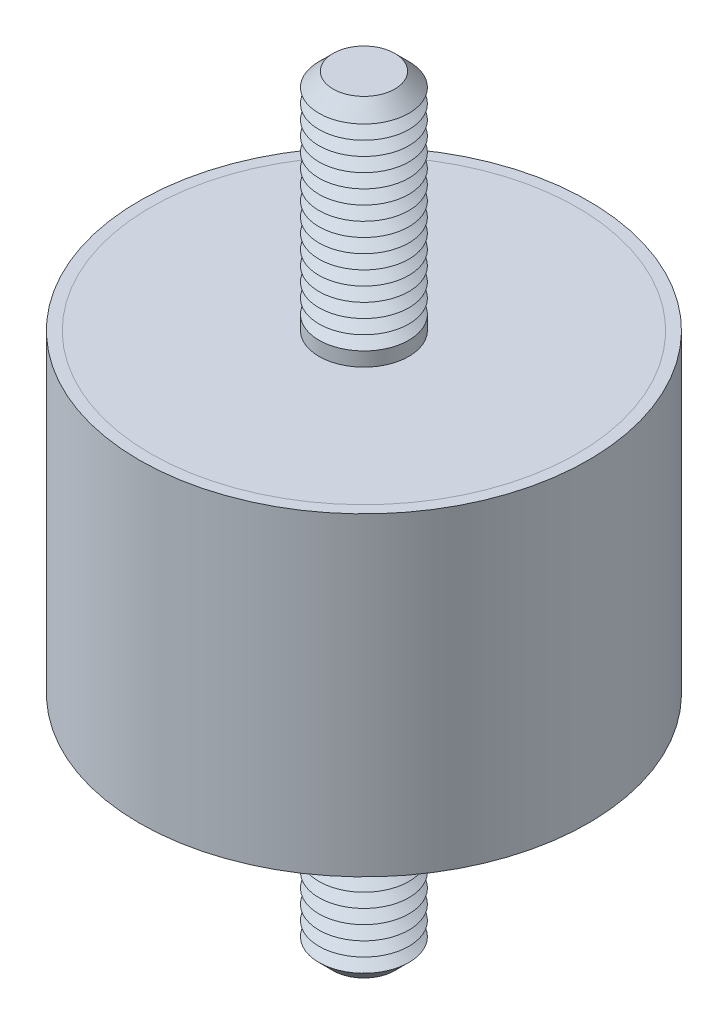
ISO-10303-21;
HEADER;
FILE_DESCRIPTION(('STEP AP214'),'2;1');
FILE_NAME('part.step','',(''),(''),'','','');
FILE_SCHEMA(('AUTOMOTIVE_DESIGN { 1 0 10303 214 1 1 1 1 }'));
ENDSEC;
DATA;
#1=APPLICATION_CONTEXT('core data for automotive mechanical design processes');
#2=APPLICATION_PROTOCOL_DEFINITION('international standard','automotive_design',2000,#1);
#3=PRODUCT_CONTEXT('',#1,'mechanical');
#4=PRODUCT('Part','Part','',(#3));
#5=PRODUCT_RELATED_PRODUCT_CATEGORY('part','',(#4));
#6=PRODUCT_DEFINITION_FORMATION('','',#4);
#7=PRODUCT_DEFINITION_CONTEXT('part definition',#1,'design');
#8=PRODUCT_DEFINITION('design','',#6,#7);
#9=PRODUCT_DEFINITION_SHAPE('','',#8);
#10=(LENGTH_UNIT() NAMED_UNIT(*) SI_UNIT(.MILLI.,.METRE.));
#11=(NAMED_UNIT(*) PLANE_ANGLE_UNIT() SI_UNIT($,.RADIAN.));
#12=(NAMED_UNIT(*) SI_UNIT($,.STERADIAN.) SOLID_ANGLE_UNIT());
#13=UNCERTAINTY_MEASURE_WITH_UNIT(LENGTH_MEASURE(1.E-05),#10,'distance_accuracy_value','');
#14=(GEOMETRIC_REPRESENTATION_CONTEXT(3) GLOBAL_UNCERTAINTY_ASSIGNED_CONTEXT((#13)) GLOBAL_UNIT_ASSIGNED_CONTEXT((#10,
#11,#12)) REPRESENTATION_CONTEXT('',''));
#15=CARTESIAN_POINT('',(0.,0.,0.));
#16=DIRECTION('',(0.,0.,1.));
#17=DIRECTION('',(1.,0.,0.));
#18=AXIS2_PLACEMENT_3D('',#15,#16,#17);
#19=CARTESIAN_POINT('',(0.,-34.,0.));
#20=DIRECTION('',(0.,1.,0.));
#21=DIRECTION('',(0.,0.,1.));
#22=AXIS2_PLACEMENT_3D('',#19,#20,#21);
#23=CYLINDRICAL_SURFACE('',#22,4.);
#24=CARTESIAN_POINT('',(0.,-14.,0.));
#25=DIRECTION('',(0.,-1.,0.));
#26=DIRECTION('',(0.,0.,-1.));
#27=AXIS2_PLACEMENT_3D('',#24,#25,#26);
#28=CIRCLE('',#27,4.);
#29=CARTESIAN_POINT('',(0.,-14.,-4.));
#30=VERTEX_POINT('',#29);
#31=EDGE_CURVE('P0_E21',#30,#30,#28,.T.);
#32=ORIENTED_EDGE('',*,*,#31,.T.);
#33=EDGE_LOOP('',(#32));
#34=FACE_BOUND('',#33,.T.);
#35=CARTESIAN_POINT('',(0.,-15.25,0.));
#36=DIRECTION('',(0.,1.,0.));
#37=DIRECTION('',(0.,0.,1.));
#38=AXIS2_PLACEMENT_3D('',#35,#36,#37);
#39=CIRCLE('',#38,4.);
#40=CARTESIAN_POINT('',(0.,-15.25,4.));
#41=VERTEX_POINT('',#40);
#42=EDGE_CURVE('P0_E33',#41,#41,#39,.T.);
#43=ORIENTED_EDGE('',*,*,#42,.T.);
#44=EDGE_LOOP('',(#43));
#45=FACE_BOUND('',#44,.T.);
#46=ADVANCED_FACE('P0_F14',(#34,#45),#23,.T.);
#47=CARTESIAN_POINT('',(0.,-14.,0.));
#48=DIRECTION('',(0.,1.,0.));
#49=DIRECTION('',(0.,0.,1.));
#50=AXIS2_PLACEMENT_3D('',#47,#48,#49);
#51=CYLINDRICAL_SURFACE('',#50,19.);
#52=CARTESIAN_POINT('',(0.,-14.,0.));
#53=DIRECTION('',(0.,1.,0.));
#54=DIRECTION('',(0.,0.,1.));
#55=AXIS2_PLACEMENT_3D('',#52,#53,#54);
#56=CIRCLE('',#55,19.);
#57=CARTESIAN_POINT('',(0.,-14.,19.));
#58=VERTEX_POINT('',#57);
#59=EDGE_CURVE('P0_E25',#58,#58,#56,.T.);
#60=ORIENTED_EDGE('',*,*,#59,.T.);
#61=EDGE_LOOP('',(#60));
#62=FACE_BOUND('',#61,.T.);
#63=CARTESIAN_POINT('',(0.,-13.,0.));
#64=DIRECTION('',(0.,1.,0.));
#65=DIRECTION('',(0.,0.,1.));
#66=AXIS2_PLACEMENT_3D('',#63,#64,#65);
#67=CIRCLE('',#66,19.);
#68=CARTESIAN_POINT('',(0.,-13.,19.));
#69=VERTEX_POINT('',#68);
#70=EDGE_CURVE('P0_E30',#69,#69,#67,.T.);
#71=ORIENTED_EDGE('',*,*,#70,.F.);
#72=EDGE_LOOP('',(#71));
#73=FACE_BOUND('',#72,.T.);
#74=ADVANCED_FACE('P0_F145',(#62,#73),#51,.T.);
#75=CARTESIAN_POINT('',(0.,-14.,0.));
#76=DIRECTION('',(0.,1.,0.));
#77=DIRECTION('',(0.,0.,1.));
#78=AXIS2_PLACEMENT_3D('',#75,#76,#77);
#79=PLANE('',#78);
#80=ORIENTED_EDGE('',*,*,#31,.F.);
#81=EDGE_LOOP('',(#80));
#82=FACE_BOUND('',#81,.T.);
#83=ORIENTED_EDGE('',*,*,#59,.F.);
#84=EDGE_LOOP('',(#83));
#85=FACE_BOUND('',#84,.T.);
#86=ADVANCED_FACE('P0_F150',(#82,#85),#79,.F.);
#87=CARTESIAN_POINT('',(0.,-13.,0.));
#88=DIRECTION('',(0.,1.,0.));
#89=DIRECTION('',(0.,0.,1.));
#90=AXIS2_PLACEMENT_3D('',#87,#88,#89);
#91=PLANE('',#90);
#92=ORIENTED_EDGE('',*,*,#70,.T.);
#93=EDGE_LOOP('',(#92));
#94=FACE_BOUND('',#93,.T.);
#95=ADVANCED_FACE('P0_F156',(#94),#91,.T.);
#96=CARTESIAN_POINT('',(0.,-15.25,0.));
#97=DIRECTION('',(0.,1.,0.));
#98=DIRECTION('',(0.,0.,1.));
#99=AXIS2_PLACEMENT_3D('',#96,#97,#98);
#100=CONICAL_SURFACE('',#99,4.,1.0471975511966);
#101=CARTESIAN_POINT('',(0.,-15.875,0.));
#102=DIRECTION('',(0.,1.,0.));
#103=DIRECTION('',(0.,0.,1.));
#104=AXIS2_PLACEMENT_3D('',#101,#102,#103);
#105=CIRCLE('',#104,2.91746824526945);
#106=CARTESIAN_POINT('',(0.,-15.875,2.91746824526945));
#107=VERTEX_POINT('',#106);
#108=EDGE_CURVE('P0_E39',#107,#107,#105,.T.);
#109=ORIENTED_EDGE('',*,*,#108,.T.);
#110=EDGE_LOOP('',(#109));
#111=FACE_BOUND('',#110,.T.);
#112=ORIENTED_EDGE('',*,*,#42,.F.);
#113=EDGE_LOOP('',(#112));
#114=FACE_BOUND('',#113,.T.);
#115=ADVANCED_FACE('P0_F159',(#111,#114),#100,.T.);
#116=CARTESIAN_POINT('',(0.,-15.875,0.));
#117=DIRECTION('',(0.,-1.,0.));
#118=DIRECTION('',(0.,0.,-1.));
#119=AXIS2_PLACEMENT_3D('',#116,#117,#118);
#120=CONICAL_SURFACE('',#119,2.91746824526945,1.0471975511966);
#121=CARTESIAN_POINT('',(0.,-16.5,0.));
#122=DIRECTION('',(0.,1.,0.));
#123=DIRECTION('',(0.,0.,1.));
#124=AXIS2_PLACEMENT_3D('',#121,#122,#123);
#125=CIRCLE('',#124,4.);
#126=CARTESIAN_POINT('',(0.,-16.5,4.));
#127=VERTEX_POINT('',#126);
#128=EDGE_CURVE('P0_E43',#127,#127,#125,.T.);
#129=ORIENTED_EDGE('',*,*,#128,.T.);
#130=EDGE_LOOP('',(#129));
#131=FACE_BOUND('',#130,.T.);
#132=ORIENTED_EDGE('',*,*,#108,.F.);
#133=EDGE_LOOP('',(#132));
#134=FACE_BOUND('',#133,.T.);
#135=ADVANCED_FACE('P0_F163',(#131,#134),#120,.T.);
#136=CARTESIAN_POINT('',(0.,-16.5,0.));
#137=DIRECTION('',(0.,1.,0.));
#138=DIRECTION('',(0.,0.,1.));
#139=AXIS2_PLACEMENT_3D('',#136,#137,#138);
#140=CONICAL_SURFACE('',#139,4.,1.0471975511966);
#141=CARTESIAN_POINT('',(0.,-17.125,0.));
#142=DIRECTION('',(0.,1.,0.));
#143=DIRECTION('',(0.,0.,1.));
#144=AXIS2_PLACEMENT_3D('',#141,#142,#143);
#145=CIRCLE('',#144,2.91746824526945);
#146=CARTESIAN_POINT('',(0.,-17.125,2.91746824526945));
#147=VERTEX_POINT('',#146);
#148=EDGE_CURVE('P0_E47',#147,#147,#145,.T.);
#149=ORIENTED_EDGE('',*,*,#148,.T.);
#150=EDGE_LOOP('',(#149));
#151=FACE_BOUND('',#150,.T.);
#152=ORIENTED_EDGE('',*,*,#128,.F.);
#153=EDGE_LOOP('',(#152));
#154=FACE_BOUND('',#153,.T.);
#155=ADVANCED_FACE('P0_F167',(#151,#154),#140,.T.);
#156=CARTESIAN_POINT('',(0.,-17.125,0.));
#157=DIRECTION('',(0.,-1.,0.));
#158=DIRECTION('',(0.,0.,-1.));
#159=AXIS2_PLACEMENT_3D('',#156,#157,#158);
#160=CONICAL_SURFACE('',#159,2.91746824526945,1.0471975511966);
#161=CARTESIAN_POINT('',(0.,-17.75,0.));
#162=DIRECTION('',(0.,1.,0.));
#163=DIRECTION('',(0.,0.,1.));
#164=AXIS2_PLACEMENT_3D('',#161,#162,#163);
#165=CIRCLE('',#164,4.);
#166=CARTESIAN_POINT('',(0.,-17.75,4.));
#167=VERTEX_POINT('',#166);
#168=EDGE_CURVE('P0_E52',#167,#167,#165,.T.);
#169=ORIENTED_EDGE('',*,*,#168,.T.);
#170=EDGE_LOOP('',(#169));
#171=FACE_BOUND('',#170,.T.);
#172=ORIENTED_EDGE('',*,*,#148,.F.);
#173=EDGE_LOOP('',(#172));
#174=FACE_BOUND('',#173,.T.);
#175=ADVANCED_FACE('P0_F174',(#171,#174),#160,.T.);
#176=CARTESIAN_POINT('',(0.,-17.75,0.));
#177=DIRECTION('',(0.,1.,0.));
#178=DIRECTION('',(0.,0.,1.));
#179=AXIS2_PLACEMENT_3D('',#176,#177,#178);
#180=CONICAL_SURFACE('',#179,4.,1.0471975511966);
#181=CARTESIAN_POINT('',(0.,-18.375,0.));
#182=DIRECTION('',(0.,1.,0.));
#183=DIRECTION('',(0.,0.,1.));
#184=AXIS2_PLACEMENT_3D('',#181,#182,#183);
#185=CIRCLE('',#184,2.91746824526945);
#186=CARTESIAN_POINT('',(0.,-18.375,2.91746824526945));
#187=VERTEX_POINT('',#186);
#188=EDGE_CURVE('P0_E55',#187,#187,#185,.T.);
#189=ORIENTED_EDGE('',*,*,#188,.T.);
#190=EDGE_LOOP('',(#189));
#191=FACE_BOUND('',#190,.T.);
#192=ORIENTED_EDGE('',*,*,#168,.F.);
#193=EDGE_LOOP('',(#192));
#194=FACE_BOUND('',#193,.T.);
#195=ADVANCED_FACE('P0_F178',(#191,#194),#180,.T.);
#196=CARTESIAN_POINT('',(0.,-18.375,0.));
#197=DIRECTION('',(0.,-1.,0.));
#198=DIRECTION('',(0.,0.,-1.));
#199=AXIS2_PLACEMENT_3D('',#196,#197,#198);
#200=CONICAL_SURFACE('',#199,2.91746824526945,1.0471975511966);
#201=CARTESIAN_POINT('',(0.,-19.,0.));
#202=DIRECTION('',(0.,1.,0.));
#203=DIRECTION('',(0.,0.,1.));
#204=AXIS2_PLACEMENT_3D('',#201,#202,#203);
#205=CIRCLE('',#204,4.);
#206=CARTESIAN_POINT('',(0.,-19.,4.));
#207=VERTEX_POINT('',#206);
#208=EDGE_CURVE('P0_E58',#207,#207,#205,.T.);
#209=ORIENTED_EDGE('',*,*,#208,.T.);
#210=EDGE_LOOP('',(#209));
#211=FACE_BOUND('',#210,.T.);
#212=ORIENTED_EDGE('',*,*,#188,.F.);
#213=EDGE_LOOP('',(#212));
#214=FACE_BOUND('',#213,.T.);
#215=ADVANCED_FACE('P0_F182',(#211,#214),#200,.T.);
#216=CARTESIAN_POINT('',(0.,-19.,0.));
#217=DIRECTION('',(0.,1.,0.));
#218=DIRECTION('',(0.,0.,1.));
#219=AXIS2_PLACEMENT_3D('',#216,#217,#218);
#220=CONICAL_SURFACE('',#219,4.,1.0471975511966);
#221=CARTESIAN_POINT('',(0.,-19.625,0.));
#222=DIRECTION('',(0.,1.,0.));
#223=DIRECTION('',(0.,0.,1.));
#224=AXIS2_PLACEMENT_3D('',#221,#222,#223);
#225=CIRCLE('',#224,2.91746824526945);
#226=CARTESIAN_POINT('',(0.,-19.625,2.91746824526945));
#227=VERTEX_POINT('',#226);
#228=EDGE_CURVE('P0_E61',#227,#227,#225,.T.);
#229=ORIENTED_EDGE('',*,*,#228,.T.);
#230=EDGE_LOOP('',(#229));
#231=FACE_BOUND('',#230,.T.);
#232=ORIENTED_EDGE('',*,*,#208,.F.);
#233=EDGE_LOOP('',(#232));
#234=FACE_BOUND('',#233,.T.);
#235=ADVANCED_FACE('P0_F186',(#231,#234),#220,.T.);
#236=CARTESIAN_POINT('',(0.,-19.625,0.));
#237=DIRECTION('',(0.,-1.,0.));
#238=DIRECTION('',(0.,0.,-1.));
#239=AXIS2_PLACEMENT_3D('',#236,#237,#238);
#240=CONICAL_SURFACE('',#239,2.91746824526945,1.0471975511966);
#241=CARTESIAN_POINT('',(0.,-20.25,0.));
#242=DIRECTION('',(0.,1.,0.));
#243=DIRECTION('',(0.,0.,1.));
#244=AXIS2_PLACEMENT_3D('',#241,#242,#243);
#245=CIRCLE('',#244,4.);
#246=CARTESIAN_POINT('',(0.,-20.25,4.));
#247=VERTEX_POINT('',#246);
#248=EDGE_CURVE('P0_E64',#247,#247,#245,.T.);
#249=ORIENTED_EDGE('',*,*,#248,.T.);
#250=EDGE_LOOP('',(#249));
#251=FACE_BOUND('',#250,.T.);
#252=ORIENTED_EDGE('',*,*,#228,.F.);
#253=EDGE_LOOP('',(#252));
#254=FACE_BOUND('',#253,.T.);
#255=ADVANCED_FACE('P0_F190',(#251,#254),#240,.T.);
#256=CARTESIAN_POINT('',(0.,-20.25,0.));
#257=DIRECTION('',(0.,1.,0.));
#258=DIRECTION('',(0.,0.,1.));
#259=AXIS2_PLACEMENT_3D('',#256,#257,#258);
#260=CONICAL_SURFACE('',#259,4.,1.0471975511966);
#261=CARTESIAN_POINT('',(0.,-20.875,0.));
#262=DIRECTION('',(0.,1.,0.));
#263=DIRECTION('',(0.,0.,1.));
#264=AXIS2_PLACEMENT_3D('',#261,#262,#263);
#265=CIRCLE('',#264,2.91746824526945);
#266=CARTESIAN_POINT('',(0.,-20.875,2.91746824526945));
#267=VERTEX_POINT('',#266);
#268=EDGE_CURVE('P0_E67',#267,#267,#265,.T.);
#269=ORIENTED_EDGE('',*,*,#268,.T.);
#270=EDGE_LOOP('',(#269));
#271=FACE_BOUND('',#270,.T.);
#272=ORIENTED_EDGE('',*,*,#248,.F.);
#273=EDGE_LOOP('',(#272));
#274=FACE_BOUND('',#273,.T.);
#275=ADVANCED_FACE('P0_F194',(#271,#274),#260,.T.);
#276=CARTESIAN_POINT('',(0.,-20.875,0.));
#277=DIRECTION('',(0.,-1.,0.));
#278=DIRECTION('',(0.,0.,-1.));
#279=AXIS2_PLACEMENT_3D('',#276,#277,#278);
#280=CONICAL_SURFACE('',#279,2.91746824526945,1.0471975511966);
#281=CARTESIAN_POINT('',(0.,-21.5,0.));
#282=DIRECTION('',(0.,1.,0.));
#283=DIRECTION('',(0.,0.,1.));
#284=AXIS2_PLACEMENT_3D('',#281,#282,#283);
#285=CIRCLE('',#284,4.);
#286=CARTESIAN_POINT('',(0.,-21.5,4.));
#287=VERTEX_POINT('',#286);
#288=EDGE_CURVE('P0_E70',#287,#287,#285,.T.);
#289=ORIENTED_EDGE('',*,*,#288,.T.);
#290=EDGE_LOOP('',(#289));
#291=FACE_BOUND('',#290,.T.);
#292=ORIENTED_EDGE('',*,*,#268,.F.);
#293=EDGE_LOOP('',(#292));
#294=FACE_BOUND('',#293,.T.);
#295=ADVANCED_FACE('P0_F198',(#291,#294),#280,.T.);
#296=CARTESIAN_POINT('',(0.,-21.5,0.));
#297=DIRECTION('',(0.,1.,0.));
#298=DIRECTION('',(0.,0.,1.));
#299=AXIS2_PLACEMENT_3D('',#296,#297,#298);
#300=CONICAL_SURFACE('',#299,4.,1.0471975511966);
#301=CARTESIAN_POINT('',(0.,-22.125,0.));
#302=DIRECTION('',(0.,1.,0.));
#303=DIRECTION('',(0.,0.,1.));
#304=AXIS2_PLACEMENT_3D('',#301,#302,#303);
#305=CIRCLE('',#304,2.91746824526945);
#306=CARTESIAN_POINT('',(0.,-22.125,2.91746824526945));
#307=VERTEX_POINT('',#306);
#308=EDGE_CURVE('P0_E73',#307,#307,#305,.T.);
#309=ORIENTED_EDGE('',*,*,#308,.T.);
#310=EDGE_LOOP('',(#309));
#311=FACE_BOUND('',#310,.T.);
#312=ORIENTED_EDGE('',*,*,#288,.F.);
#313=EDGE_LOOP('',(#312));
#314=FACE_BOUND('',#313,.T.);
#315=ADVANCED_FACE('P0_F202',(#311,#314),#300,.T.);
#316=CARTESIAN_POINT('',(0.,-22.125,0.));
#317=DIRECTION('',(0.,-1.,0.));
#318=DIRECTION('',(0.,0.,-1.));
#319=AXIS2_PLACEMENT_3D('',#316,#317,#318);
#320=CONICAL_SURFACE('',#319,2.91746824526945,1.0471975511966);
#321=CARTESIAN_POINT('',(0.,-22.75,0.));
#322=DIRECTION('',(0.,1.,0.));
#323=DIRECTION('',(0.,0.,1.));
#324=AXIS2_PLACEMENT_3D('',#321,#322,#323);
#325=CIRCLE('',#324,4.);
#326=CARTESIAN_POINT('',(0.,-22.75,4.));
#327=VERTEX_POINT('',#326);
#328=EDGE_CURVE('P0_E76',#327,#327,#325,.T.);
#329=ORIENTED_EDGE('',*,*,#328,.T.);
#330=EDGE_LOOP('',(#329));
#331=FACE_BOUND('',#330,.T.);
#332=ORIENTED_EDGE('',*,*,#308,.F.);
#333=EDGE_LOOP('',(#332));
#334=FACE_BOUND('',#333,.T.);
#335=ADVANCED_FACE('P0_F206',(#331,#334),#320,.T.);
#336=CARTESIAN_POINT('',(0.,-22.75,0.));
#337=DIRECTION('',(0.,1.,0.));
#338=DIRECTION('',(0.,0.,1.));
#339=AXIS2_PLACEMENT_3D('',#336,#337,#338);
#340=CONICAL_SURFACE('',#339,4.,1.0471975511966);
#341=CARTESIAN_POINT('',(0.,-23.375,0.));
#342=DIRECTION('',(0.,1.,0.));
#343=DIRECTION('',(0.,0.,1.));
#344=AXIS2_PLACEMENT_3D('',#341,#342,#343);
#345=CIRCLE('',#344,2.91746824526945);
#346=CARTESIAN_POINT('',(0.,-23.375,2.91746824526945));
#347=VERTEX_POINT('',#346);
#348=EDGE_CURVE('P0_E79',#347,#347,#345,.T.);
#349=ORIENTED_EDGE('',*,*,#348,.T.);
#350=EDGE_LOOP('',(#349));
#351=FACE_BOUND('',#350,.T.);
#352=ORIENTED_EDGE('',*,*,#328,.F.);
#353=EDGE_LOOP('',(#352));
#354=FACE_BOUND('',#353,.T.);
#355=ADVANCED_FACE('P0_F210',(#351,#354),#340,.T.);
#356=CARTESIAN_POINT('',(0.,-23.375,0.));
#357=DIRECTION('',(0.,-1.,0.));
#358=DIRECTION('',(0.,0.,-1.));
#359=AXIS2_PLACEMENT_3D('',#356,#357,#358);
#360=CONICAL_SURFACE('',#359,2.91746824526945,1.0471975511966);
#361=CARTESIAN_POINT('',(0.,-24.,0.));
#362=DIRECTION('',(0.,1.,0.));
#363=DIRECTION('',(0.,0.,1.));
#364=AXIS2_PLACEMENT_3D('',#361,#362,#363);
#365=CIRCLE('',#364,4.);
#366=CARTESIAN_POINT('',(0.,-24.,4.));
#367=VERTEX_POINT('',#366);
#368=EDGE_CURVE('P0_E82',#367,#367,#365,.T.);
#369=ORIENTED_EDGE('',*,*,#368,.T.);
#370=EDGE_LOOP('',(#369));
#371=FACE_BOUND('',#370,.T.);
#372=ORIENTED_EDGE('',*,*,#348,.F.);
#373=EDGE_LOOP('',(#372));
#374=FACE_BOUND('',#373,.T.);
#375=ADVANCED_FACE('P0_F214',(#371,#374),#360,.T.);
#376=CARTESIAN_POINT('',(0.,-24.,0.));
#377=DIRECTION('',(0.,1.,0.));
#378=DIRECTION('',(0.,0.,1.));
#379=AXIS2_PLACEMENT_3D('',#376,#377,#378);
#380=CONICAL_SURFACE('',#379,4.,1.0471975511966);
#381=CARTESIAN_POINT('',(0.,-24.625,0.));
#382=DIRECTION('',(0.,1.,0.));
#383=DIRECTION('',(0.,0.,1.));
#384=AXIS2_PLACEMENT_3D('',#381,#382,#383);
#385=CIRCLE('',#384,2.91746824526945);
#386=CARTESIAN_POINT('',(0.,-24.625,2.91746824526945));
#387=VERTEX_POINT('',#386);
#388=EDGE_CURVE('P0_E85',#387,#387,#385,.T.);
#389=ORIENTED_EDGE('',*,*,#388,.T.);
#390=EDGE_LOOP('',(#389));
#391=FACE_BOUND('',#390,.T.);
#392=ORIENTED_EDGE('',*,*,#368,.F.);
#393=EDGE_LOOP('',(#392));
#394=FACE_BOUND('',#393,.T.);
#395=ADVANCED_FACE('P0_F218',(#391,#394),#380,.T.);
#396=CARTESIAN_POINT('',(0.,-24.625,0.));
#397=DIRECTION('',(0.,-1.,0.));
#398=DIRECTION('',(0.,0.,-1.));
#399=AXIS2_PLACEMENT_3D('',#396,#397,#398);
#400=CONICAL_SURFACE('',#399,2.91746824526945,1.0471975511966);
#401=CARTESIAN_POINT('',(0.,-25.25,0.));
#402=DIRECTION('',(0.,1.,0.));
#403=DIRECTION('',(0.,0.,1.));
#404=AXIS2_PLACEMENT_3D('',#401,#402,#403);
#405=CIRCLE('',#404,4.);
#406=CARTESIAN_POINT('',(0.,-25.25,4.));
#407=VERTEX_POINT('',#406);
#408=EDGE_CURVE('P0_E88',#407,#407,#405,.T.);
#409=ORIENTED_EDGE('',*,*,#408,.T.);
#410=EDGE_LOOP('',(#409));
#411=FACE_BOUND('',#410,.T.);
#412=ORIENTED_EDGE('',*,*,#388,.F.);
#413=EDGE_LOOP('',(#412));
#414=FACE_BOUND('',#413,.T.);
#415=ADVANCED_FACE('P0_F222',(#411,#414),#400,.T.);
#416=CARTESIAN_POINT('',(0.,-25.25,0.));
#417=DIRECTION('',(0.,1.,0.));
#418=DIRECTION('',(0.,0.,1.));
#419=AXIS2_PLACEMENT_3D('',#416,#417,#418);
#420=CONICAL_SURFACE('',#419,4.,1.0471975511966);
#421=CARTESIAN_POINT('',(0.,-25.875,0.));
#422=DIRECTION('',(0.,1.,0.));
#423=DIRECTION('',(0.,0.,1.));
#424=AXIS2_PLACEMENT_3D('',#421,#422,#423);
#425=CIRCLE('',#424,2.91746824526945);
#426=CARTESIAN_POINT('',(0.,-25.875,2.91746824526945));
#427=VERTEX_POINT('',#426);
#428=EDGE_CURVE('P0_E91',#427,#427,#425,.T.);
#429=ORIENTED_EDGE('',*,*,#428,.T.);
#430=EDGE_LOOP('',(#429));
#431=FACE_BOUND('',#430,.T.);
#432=ORIENTED_EDGE('',*,*,#408,.F.);
#433=EDGE_LOOP('',(#432));
#434=FACE_BOUND('',#433,.T.);
#435=ADVANCED_FACE('P0_F226',(#431,#434),#420,.T.);
#436=CARTESIAN_POINT('',(0.,-25.875,0.));
#437=DIRECTION('',(0.,-1.,0.));
#438=DIRECTION('',(0.,0.,-1.));
#439=AXIS2_PLACEMENT_3D('',#436,#437,#438);
#440=CONICAL_SURFACE('',#439,2.91746824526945,1.0471975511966);
#441=CARTESIAN_POINT('',(0.,-26.5,0.));
#442=DIRECTION('',(0.,1.,0.));
#443=DIRECTION('',(0.,0.,1.));
#444=AXIS2_PLACEMENT_3D('',#441,#442,#443);
#445=CIRCLE('',#444,4.);
#446=CARTESIAN_POINT('',(0.,-26.5,4.));
#447=VERTEX_POINT('',#446);
#448=EDGE_CURVE('P0_E94',#447,#447,#445,.T.);
#449=ORIENTED_EDGE('',*,*,#448,.T.);
#450=EDGE_LOOP('',(#449));
#451=FACE_BOUND('',#450,.T.);
#452=ORIENTED_EDGE('',*,*,#428,.F.);
#453=EDGE_LOOP('',(#452));
#454=FACE_BOUND('',#453,.T.);
#455=ADVANCED_FACE('P0_F230',(#451,#454),#440,.T.);
#456=CARTESIAN_POINT('',(0.,-26.5,0.));
#457=DIRECTION('',(0.,1.,0.));
#458=DIRECTION('',(0.,0.,1.));
#459=AXIS2_PLACEMENT_3D('',#456,#457,#458);
#460=CONICAL_SURFACE('',#459,4.,1.0471975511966);
#461=CARTESIAN_POINT('',(0.,-27.125,0.));
#462=DIRECTION('',(0.,1.,0.));
#463=DIRECTION('',(0.,0.,1.));
#464=AXIS2_PLACEMENT_3D('',#461,#462,#463);
#465=CIRCLE('',#464,2.91746824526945);
#466=CARTESIAN_POINT('',(0.,-27.125,2.91746824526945));
#467=VERTEX_POINT('',#466);
#468=EDGE_CURVE('P0_E97',#467,#467,#465,.T.);
#469=ORIENTED_EDGE('',*,*,#468,.T.);
#470=EDGE_LOOP('',(#469));
#471=FACE_BOUND('',#470,.T.);
#472=ORIENTED_EDGE('',*,*,#448,.F.);
#473=EDGE_LOOP('',(#472));
#474=FACE_BOUND('',#473,.T.);
#475=ADVANCED_FACE('P0_F234',(#471,#474),#460,.T.);
#476=CARTESIAN_POINT('',(0.,-27.125,0.));
#477=DIRECTION('',(0.,-1.,0.));
#478=DIRECTION('',(0.,0.,-1.));
#479=AXIS2_PLACEMENT_3D('',#476,#477,#478);
#480=CONICAL_SURFACE('',#479,2.91746824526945,1.0471975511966);
#481=CARTESIAN_POINT('',(0.,-27.75,0.));
#482=DIRECTION('',(0.,1.,0.));
#483=DIRECTION('',(0.,0.,1.));
#484=AXIS2_PLACEMENT_3D('',#481,#482,#483);
#485=CIRCLE('',#484,4.);
#486=CARTESIAN_POINT('',(0.,-27.75,4.));
#487=VERTEX_POINT('',#486);
#488=EDGE_CURVE('P0_E100',#487,#487,#485,.T.);
#489=ORIENTED_EDGE('',*,*,#488,.T.);
#490=EDGE_LOOP('',(#489));
#491=FACE_BOUND('',#490,.T.);
#492=ORIENTED_EDGE('',*,*,#468,.F.);
#493=EDGE_LOOP('',(#492));
#494=FACE_BOUND('',#493,.T.);
#495=ADVANCED_FACE('P0_F238',(#491,#494),#480,.T.);
#496=CARTESIAN_POINT('',(0.,-27.75,0.));
#497=DIRECTION('',(0.,1.,0.));
#498=DIRECTION('',(0.,0.,1.));
#499=AXIS2_PLACEMENT_3D('',#496,#497,#498);
#500=CONICAL_SURFACE('',#499,4.,1.0471975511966);
#501=CARTESIAN_POINT('',(0.,-28.375,0.));
#502=DIRECTION('',(0.,1.,0.));
#503=DIRECTION('',(0.,0.,1.));
#504=AXIS2_PLACEMENT_3D('',#501,#502,#503);
#505=CIRCLE('',#504,2.91746824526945);
#506=CARTESIAN_POINT('',(0.,-28.375,2.91746824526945));
#507=VERTEX_POINT('',#506);
#508=EDGE_CURVE('P0_E103',#507,#507,#505,.T.);
#509=ORIENTED_EDGE('',*,*,#508,.T.);
#510=EDGE_LOOP('',(#509));
#511=FACE_BOUND('',#510,.T.);
#512=ORIENTED_EDGE('',*,*,#488,.F.);
#513=EDGE_LOOP('',(#512));
#514=FACE_BOUND('',#513,.T.);
#515=ADVANCED_FACE('P0_F242',(#511,#514),#500,.T.);
#516=CARTESIAN_POINT('',(0.,-28.375,0.));
#517=DIRECTION('',(0.,-1.,0.));
#518=DIRECTION('',(0.,0.,-1.));
#519=AXIS2_PLACEMENT_3D('',#516,#517,#518);
#520=CONICAL_SURFACE('',#519,2.91746824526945,1.0471975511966);
#521=CARTESIAN_POINT('',(0.,-29.,0.));
#522=DIRECTION('',(0.,1.,0.));
#523=DIRECTION('',(0.,0.,1.));
#524=AXIS2_PLACEMENT_3D('',#521,#522,#523);
#525=CIRCLE('',#524,4.);
#526=CARTESIAN_POINT('',(0.,-29.,4.));
#527=VERTEX_POINT('',#526);
#528=EDGE_CURVE('P0_E106',#527,#527,#525,.T.);
#529=ORIENTED_EDGE('',*,*,#528,.T.);
#530=EDGE_LOOP('',(#529));
#531=FACE_BOUND('',#530,.T.);
#532=ORIENTED_EDGE('',*,*,#508,.F.);
#533=EDGE_LOOP('',(#532));
#534=FACE_BOUND('',#533,.T.);
#535=ADVANCED_FACE('P0_F246',(#531,#534),#520,.T.);
#536=CARTESIAN_POINT('',(0.,-29.,0.));
#537=DIRECTION('',(0.,1.,0.));
#538=DIRECTION('',(0.,0.,1.));
#539=AXIS2_PLACEMENT_3D('',#536,#537,#538);
#540=CONICAL_SURFACE('',#539,4.,1.0471975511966);
#541=CARTESIAN_POINT('',(0.,-29.625,0.));
#542=DIRECTION('',(0.,1.,0.));
#543=DIRECTION('',(0.,0.,1.));
#544=AXIS2_PLACEMENT_3D('',#541,#542,#543);
#545=CIRCLE('',#544,2.91746824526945);
#546=CARTESIAN_POINT('',(0.,-29.625,2.91746824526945));
#547=VERTEX_POINT('',#546);
#548=EDGE_CURVE('P0_E109',#547,#547,#545,.T.);
#549=ORIENTED_EDGE('',*,*,#548,.T.);
#550=EDGE_LOOP('',(#549));
#551=FACE_BOUND('',#550,.T.);
#552=ORIENTED_EDGE('',*,*,#528,.F.);
#553=EDGE_LOOP('',(#552));
#554=FACE_BOUND('',#553,.T.);
#555=ADVANCED_FACE('P0_F250',(#551,#554),#540,.T.);
#556=CARTESIAN_POINT('',(0.,-29.625,0.));
#557=DIRECTION('',(0.,-1.,0.));
#558=DIRECTION('',(0.,0.,-1.));
#559=AXIS2_PLACEMENT_3D('',#556,#557,#558);
#560=CONICAL_SURFACE('',#559,2.91746824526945,1.0471975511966);
#561=CARTESIAN_POINT('',(0.,-30.25,0.));
#562=DIRECTION('',(0.,1.,0.));
#563=DIRECTION('',(0.,0.,1.));
#564=AXIS2_PLACEMENT_3D('',#561,#562,#563);
#565=CIRCLE('',#564,4.);
#566=CARTESIAN_POINT('',(0.,-30.25,4.));
#567=VERTEX_POINT('',#566);
#568=EDGE_CURVE('P0_E112',#567,#567,#565,.T.);
#569=ORIENTED_EDGE('',*,*,#568,.T.);
#570=EDGE_LOOP('',(#569));
#571=FACE_BOUND('',#570,.T.);
#572=ORIENTED_EDGE('',*,*,#548,.F.);
#573=EDGE_LOOP('',(#572));
#574=FACE_BOUND('',#573,.T.);
#575=ADVANCED_FACE('P0_F254',(#571,#574),#560,.T.);
#576=CARTESIAN_POINT('',(0.,-30.25,0.));
#577=DIRECTION('',(0.,1.,0.));
#578=DIRECTION('',(0.,0.,1.));
#579=AXIS2_PLACEMENT_3D('',#576,#577,#578);
#580=CONICAL_SURFACE('',#579,4.,1.0471975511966);
#581=CARTESIAN_POINT('',(0.,-30.875,0.));
#582=DIRECTION('',(0.,1.,0.));
#583=DIRECTION('',(0.,0.,1.));
#584=AXIS2_PLACEMENT_3D('',#581,#582,#583);
#585=CIRCLE('',#584,2.91746824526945);
#586=CARTESIAN_POINT('',(0.,-30.875,2.91746824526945));
#587=VERTEX_POINT('',#586);
#588=EDGE_CURVE('P0_E115',#587,#587,#585,.T.);
#589=ORIENTED_EDGE('',*,*,#588,.T.);
#590=EDGE_LOOP('',(#589));
#591=FACE_BOUND('',#590,.T.);
#592=ORIENTED_EDGE('',*,*,#568,.F.);
#593=EDGE_LOOP('',(#592));
#594=FACE_BOUND('',#593,.T.);
#595=ADVANCED_FACE('P0_F258',(#591,#594),#580,.T.);
#596=CARTESIAN_POINT('',(0.,-30.875,0.));
#597=DIRECTION('',(0.,-1.,0.));
#598=DIRECTION('',(0.,0.,-1.));
#599=AXIS2_PLACEMENT_3D('',#596,#597,#598);
#600=CONICAL_SURFACE('',#599,2.91746824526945,1.0471975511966);
#601=CARTESIAN_POINT('',(0.,-31.5,0.));
#602=DIRECTION('',(0.,1.,0.));
#603=DIRECTION('',(0.,0.,1.));
#604=AXIS2_PLACEMENT_3D('',#601,#602,#603);
#605=CIRCLE('',#604,4.);
#606=CARTESIAN_POINT('',(0.,-31.5,4.));
#607=VERTEX_POINT('',#606);
#608=EDGE_CURVE('P0_E118',#607,#607,#605,.T.);
#609=ORIENTED_EDGE('',*,*,#608,.T.);
#610=EDGE_LOOP('',(#609));
#611=FACE_BOUND('',#610,.T.);
#612=ORIENTED_EDGE('',*,*,#588,.F.);
#613=EDGE_LOOP('',(#612));
#614=FACE_BOUND('',#613,.T.);
#615=ADVANCED_FACE('P0_F142',(#611,#614),#600,.T.);
#616=CARTESIAN_POINT('',(0.,-31.5,0.));
#617=DIRECTION('',(0.,1.,0.));
#618=DIRECTION('',(0.,0.,1.));
#619=AXIS2_PLACEMENT_3D('',#616,#617,#618);
#620=CONICAL_SURFACE('',#619,4.,1.0471975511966);
#621=CARTESIAN_POINT('',(0.,-32.125,0.));
#622=DIRECTION('',(0.,1.,0.));
#623=DIRECTION('',(0.,0.,1.));
#624=AXIS2_PLACEMENT_3D('',#621,#622,#623);
#625=CIRCLE('',#624,2.91746824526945);
#626=CARTESIAN_POINT('',(0.,-32.125,2.91746824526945));
#627=VERTEX_POINT('',#626);
#628=EDGE_CURVE('P0_E124',#627,#627,#625,.T.);
#629=ORIENTED_EDGE('',*,*,#628,.T.);
#630=EDGE_LOOP('',(#629));
#631=FACE_BOUND('',#630,.T.);
#632=ORIENTED_EDGE('',*,*,#608,.F.);
#633=EDGE_LOOP('',(#632));
#634=FACE_BOUND('',#633,.T.);
#635=ADVANCED_FACE('P0_F128',(#631,#634),#620,.T.);
#636=CARTESIAN_POINT('',(0.,-32.125,0.));
#637=DIRECTION('',(0.,-1.,0.));
#638=DIRECTION('',(0.,0.,-1.));
#639=AXIS2_PLACEMENT_3D('',#636,#637,#638);
#640=CONICAL_SURFACE('',#639,2.91746824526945,1.0471975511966);
#641=CARTESIAN_POINT('',(0.,-32.75,0.));
#642=DIRECTION('',(0.,1.,0.));
#643=DIRECTION('',(0.,0.,1.));
#644=AXIS2_PLACEMENT_3D('',#641,#642,#643);
#645=CIRCLE('',#644,4.);
#646=CARTESIAN_POINT('',(0.,-32.75,4.));
#647=VERTEX_POINT('',#646);
#648=EDGE_CURVE('P0_E121',#647,#647,#645,.T.);
#649=ORIENTED_EDGE('',*,*,#648,.T.);
#650=EDGE_LOOP('',(#649));
#651=FACE_BOUND('',#650,.T.);
#652=ORIENTED_EDGE('',*,*,#628,.F.);
#653=EDGE_LOOP('',(#652));
#654=FACE_BOUND('',#653,.T.);
#655=ADVANCED_FACE('P0_F131',(#651,#654),#640,.T.);
#656=CARTESIAN_POINT('',(0.,-34.,0.));
#657=DIRECTION('',(0.,-1.,0.));
#658=DIRECTION('',(0.,0.,-1.));
#659=AXIS2_PLACEMENT_3D('',#656,#657,#658);
#660=PLANE('',#659);
#661=CARTESIAN_POINT('',(0.,-34.,0.));
#662=DIRECTION('',(0.,-1.,0.));
#663=DIRECTION('',(0.,0.,-1.));
#664=AXIS2_PLACEMENT_3D('',#661,#662,#663);
#665=CIRCLE('',#664,2.75);
#666=CARTESIAN_POINT('',(0.,-34.,-2.75));
#667=VERTEX_POINT('',#666);
#668=EDGE_CURVE('P0_E10',#667,#667,#665,.T.);
#669=ORIENTED_EDGE('',*,*,#668,.T.);
#670=EDGE_LOOP('',(#669));
#671=FACE_BOUND('',#670,.T.);
#672=ADVANCED_FACE('P0_F133',(#671),#660,.T.);
#673=CARTESIAN_POINT('',(0.,-34.,0.));
#674=DIRECTION('',(0.,1.,0.));
#675=DIRECTION('',(0.,0.,1.));
#676=AXIS2_PLACEMENT_3D('',#673,#674,#675);
#677=CONICAL_SURFACE('',#676,2.75,0.785398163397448);
#678=ORIENTED_EDGE('',*,*,#648,.F.);
#679=EDGE_LOOP('',(#678));
#680=FACE_BOUND('',#679,.T.);
#681=ORIENTED_EDGE('',*,*,#668,.F.);
#682=EDGE_LOOP('',(#681));
#683=FACE_BOUND('',#682,.T.);
#684=ADVANCED_FACE('P0_F16',(#680,#683),#677,.T.);
#685=CLOSED_SHELL('',(#46,#74,#86,#95,#115,#135,#155,#175,#195,#215,#235,#255,#275,#295,#315,
#335,#355,#375,#395,#415,#435,#455,#475,#495,#515,#535,#555,#575,#595,#615,#635,#655,#672,#684));
#686=MANIFOLD_SOLID_BREP('P0_B1',#685);
#687=CARTESIAN_POINT('',(0.,34.,0.));
#688=DIRECTION('',(0.,-1.,0.));
#689=DIRECTION('',(0.,0.,-1.));
#690=AXIS2_PLACEMENT_3D('',#687,#688,#689);
#691=CYLINDRICAL_SURFACE('',#690,4.);
#692=CARTESIAN_POINT('',(0.,15.25,0.));
#693=DIRECTION('',(0.,1.,0.));
#694=DIRECTION('',(0.,0.,1.));
#695=AXIS2_PLACEMENT_3D('',#692,#693,#694);
#696=CIRCLE('',#695,4.);
#697=CARTESIAN_POINT('',(0.,15.25,4.));
#698=VERTEX_POINT('',#697);
#699=EDGE_CURVE('P1_E33',#698,#698,#696,.T.);
#700=ORIENTED_EDGE('',*,*,#699,.F.);
#701=EDGE_LOOP('',(#700));
#702=FACE_BOUND('',#701,.T.);
#703=CARTESIAN_POINT('',(0.,14.,0.));
#704=DIRECTION('',(0.,1.,0.));
#705=DIRECTION('',(0.,0.,1.));
#706=AXIS2_PLACEMENT_3D('',#703,#704,#705);
#707=CIRCLE('',#706,4.);
#708=CARTESIAN_POINT('',(0.,14.,4.));
#709=VERTEX_POINT('',#708);
#710=EDGE_CURVE('P1_E21',#709,#709,#707,.T.);
#711=ORIENTED_EDGE('',*,*,#710,.T.);
#712=EDGE_LOOP('',(#711));
#713=FACE_BOUND('',#712,.T.);
#714=ADVANCED_FACE('P1_F14',(#702,#713),#691,.T.);
#715=CARTESIAN_POINT('',(0.,14.,0.));
#716=DIRECTION('',(0.,-1.,0.));
#717=DIRECTION('',(0.,0.,-1.));
#718=AXIS2_PLACEMENT_3D('',#715,#716,#717);
#719=CYLINDRICAL_SURFACE('',#718,19.);
#720=CARTESIAN_POINT('',(0.,14.,0.));
#721=DIRECTION('',(0.,1.,0.));
#722=DIRECTION('',(0.,0.,1.));
#723=AXIS2_PLACEMENT_3D('',#720,#721,#722);
#724=CIRCLE('',#723,19.);
#725=CARTESIAN_POINT('',(0.,14.,19.));
#726=VERTEX_POINT('',#725);
#727=EDGE_CURVE('P1_E25',#726,#726,#724,.T.);
#728=ORIENTED_EDGE('',*,*,#727,.F.);
#729=EDGE_LOOP('',(#728));
#730=FACE_BOUND('',#729,.T.);
#731=CARTESIAN_POINT('',(0.,13.,0.));
#732=DIRECTION('',(0.,1.,0.));
#733=DIRECTION('',(0.,0.,1.));
#734=AXIS2_PLACEMENT_3D('',#731,#732,#733);
#735=CIRCLE('',#734,19.);
#736=CARTESIAN_POINT('',(0.,13.,19.));
#737=VERTEX_POINT('',#736);
#738=EDGE_CURVE('P1_E30',#737,#737,#735,.T.);
#739=ORIENTED_EDGE('',*,*,#738,.T.);
#740=EDGE_LOOP('',(#739));
#741=FACE_BOUND('',#740,.T.);
#742=ADVANCED_FACE('P1_F292',(#730,#741),#719,.T.);
#743=CARTESIAN_POINT('',(0.,14.,0.));
#744=DIRECTION('',(0.,1.,0.));
#745=DIRECTION('',(0.,0.,1.));
#746=AXIS2_PLACEMENT_3D('',#743,#744,#745);
#747=PLANE('',#746);
#748=ORIENTED_EDGE('',*,*,#710,.F.);
#749=EDGE_LOOP('',(#748));
#750=FACE_BOUND('',#749,.T.);
#751=ORIENTED_EDGE('',*,*,#727,.T.);
#752=EDGE_LOOP('',(#751));
#753=FACE_BOUND('',#752,.T.);
#754=ADVANCED_FACE('P1_F298',(#750,#753),#747,.T.);
#755=CARTESIAN_POINT('',(0.,13.,0.));
#756=DIRECTION('',(0.,1.,0.));
#757=DIRECTION('',(0.,0.,1.));
#758=AXIS2_PLACEMENT_3D('',#755,#756,#757);
#759=PLANE('',#758);
#760=ORIENTED_EDGE('',*,*,#738,.F.);
#761=EDGE_LOOP('',(#760));
#762=FACE_BOUND('',#761,.T.);
#763=ADVANCED_FACE('P1_F288',(#762),#759,.F.);
#764=CARTESIAN_POINT('',(0.,15.25,0.));
#765=DIRECTION('',(0.,-1.,0.));
#766=DIRECTION('',(0.,0.,-1.));
#767=AXIS2_PLACEMENT_3D('',#764,#765,#766);
#768=CONICAL_SURFACE('',#767,4.,1.0471975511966);
#769=CARTESIAN_POINT('',(0.,15.875,0.));
#770=DIRECTION('',(0.,1.,0.));
#771=DIRECTION('',(0.,0.,1.));
#772=AXIS2_PLACEMENT_3D('',#769,#770,#771);
#773=CIRCLE('',#772,2.91746824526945);
#774=CARTESIAN_POINT('',(0.,15.875,2.91746824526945));
#775=VERTEX_POINT('',#774);
#776=EDGE_CURVE('P1_E39',#775,#775,#773,.T.);
#777=ORIENTED_EDGE('',*,*,#776,.F.);
#778=EDGE_LOOP('',(#777));
#779=FACE_BOUND('',#778,.T.);
#780=ORIENTED_EDGE('',*,*,#699,.T.);
#781=EDGE_LOOP('',(#780));
#782=FACE_BOUND('',#781,.T.);
#783=ADVANCED_FACE('P1_F282',(#779,#782),#768,.T.);
#784=CARTESIAN_POINT('',(0.,15.875,0.));
#785=DIRECTION('',(0.,1.,0.));
#786=DIRECTION('',(0.,0.,1.));
#787=AXIS2_PLACEMENT_3D('',#784,#785,#786);
#788=CONICAL_SURFACE('',#787,2.91746824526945,1.0471975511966);
#789=CARTESIAN_POINT('',(0.,16.5,0.));
#790=DIRECTION('',(0.,1.,0.));
#791=DIRECTION('',(0.,0.,1.));
#792=AXIS2_PLACEMENT_3D('',#789,#790,#791);
#793=CIRCLE('',#792,4.);
#794=CARTESIAN_POINT('',(0.,16.5,4.));
#795=VERTEX_POINT('',#794);
#796=EDGE_CURVE('P1_E43',#795,#795,#793,.T.);
#797=ORIENTED_EDGE('',*,*,#796,.F.);
#798=EDGE_LOOP('',(#797));
#799=FACE_BOUND('',#798,.T.);
#800=ORIENTED_EDGE('',*,*,#776,.T.);
#801=EDGE_LOOP('',(#800));
#802=FACE_BOUND('',#801,.T.);
#803=ADVANCED_FACE('P1_F277',(#799,#802),#788,.T.);
#804=CARTESIAN_POINT('',(0.,16.5,0.));
#805=DIRECTION('',(0.,-1.,0.));
#806=DIRECTION('',(0.,0.,-1.));
#807=AXIS2_PLACEMENT_3D('',#804,#805,#806);
#808=CONICAL_SURFACE('',#807,4.,1.0471975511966);
#809=CARTESIAN_POINT('',(0.,17.125,0.));
#810=DIRECTION('',(0.,1.,0.));
#811=DIRECTION('',(0.,0.,1.));
#812=AXIS2_PLACEMENT_3D('',#809,#810,#811);
#813=CIRCLE('',#812,2.91746824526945);
#814=CARTESIAN_POINT('',(0.,17.125,2.91746824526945));
#815=VERTEX_POINT('',#814);
#816=EDGE_CURVE('P1_E47',#815,#815,#813,.T.);
#817=ORIENTED_EDGE('',*,*,#816,.F.);
#818=EDGE_LOOP('',(#817));
#819=FACE_BOUND('',#818,.T.);
#820=ORIENTED_EDGE('',*,*,#796,.T.);
#821=EDGE_LOOP('',(#820));
#822=FACE_BOUND('',#821,.T.);
#823=ADVANCED_FACE('P1_F271',(#819,#822),#808,.T.);
#824=CARTESIAN_POINT('',(0.,17.125,0.));
#825=DIRECTION('',(0.,1.,0.));
#826=DIRECTION('',(0.,0.,1.));
#827=AXIS2_PLACEMENT_3D('',#824,#825,#826);
#828=CONICAL_SURFACE('',#827,2.91746824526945,1.0471975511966);
#829=CARTESIAN_POINT('',(0.,17.75,0.));
#830=DIRECTION('',(0.,1.,0.));
#831=DIRECTION('',(0.,0.,1.));
#832=AXIS2_PLACEMENT_3D('',#829,#830,#831);
#833=CIRCLE('',#832,4.);
#834=CARTESIAN_POINT('',(0.,17.75,4.));
#835=VERTEX_POINT('',#834);
#836=EDGE_CURVE('P1_E52',#835,#835,#833,.T.);
#837=ORIENTED_EDGE('',*,*,#836,.F.);
#838=EDGE_LOOP('',(#837));
#839=FACE_BOUND('',#838,.T.);
#840=ORIENTED_EDGE('',*,*,#816,.T.);
#841=EDGE_LOOP('',(#840));
#842=FACE_BOUND('',#841,.T.);
#843=ADVANCED_FACE('P1_F265',(#839,#842),#828,.T.);
#844=CARTESIAN_POINT('',(0.,17.75,0.));
#845=DIRECTION('',(0.,-1.,0.));
#846=DIRECTION('',(0.,0.,-1.));
#847=AXIS2_PLACEMENT_3D('',#844,#845,#846);
#848=CONICAL_SURFACE('',#847,4.,1.0471975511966);
#849=CARTESIAN_POINT('',(0.,18.375,0.));
#850=DIRECTION('',(0.,1.,0.));
#851=DIRECTION('',(0.,0.,1.));
#852=AXIS2_PLACEMENT_3D('',#849,#850,#851);
#853=CIRCLE('',#852,2.91746824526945);
#854=CARTESIAN_POINT('',(0.,18.375,2.91746824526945));
#855=VERTEX_POINT('',#854);
#856=EDGE_CURVE('P1_E55',#855,#855,#853,.T.);
#857=ORIENTED_EDGE('',*,*,#856,.F.);
#858=EDGE_LOOP('',(#857));
#859=FACE_BOUND('',#858,.T.);
#860=ORIENTED_EDGE('',*,*,#836,.T.);
#861=EDGE_LOOP('',(#860));
#862=FACE_BOUND('',#861,.T.);
#863=ADVANCED_FACE('P1_F259',(#859,#862),#848,.T.);
#864=CARTESIAN_POINT('',(0.,18.375,0.));
#865=DIRECTION('',(0.,1.,0.));
#866=DIRECTION('',(0.,0.,1.));
#867=AXIS2_PLACEMENT_3D('',#864,#865,#866);
#868=CONICAL_SURFACE('',#867,2.91746824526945,1.0471975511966);
#869=CARTESIAN_POINT('',(0.,19.,0.));
#870=DIRECTION('',(0.,1.,0.));
#871=DIRECTION('',(0.,0.,1.));
#872=AXIS2_PLACEMENT_3D('',#869,#870,#871);
#873=CIRCLE('',#872,4.);
#874=CARTESIAN_POINT('',(0.,19.,4.));
#875=VERTEX_POINT('',#874);
#876=EDGE_CURVE('P1_E58',#875,#875,#873,.T.);
#877=ORIENTED_EDGE('',*,*,#876,.F.);
#878=EDGE_LOOP('',(#877));
#879=FACE_BOUND('',#878,.T.);
#880=ORIENTED_EDGE('',*,*,#856,.T.);
#881=EDGE_LOOP('',(#880));
#882=FACE_BOUND('',#881,.T.);
#883=ADVANCED_FACE('P1_F253',(#879,#882),#868,.T.);
#884=CARTESIAN_POINT('',(0.,19.,0.));
#885=DIRECTION('',(0.,-1.,0.));
#886=DIRECTION('',(0.,0.,-1.));
#887=AXIS2_PLACEMENT_3D('',#884,#885,#886);
#888=CONICAL_SURFACE('',#887,4.,1.0471975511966);
#889=CARTESIAN_POINT('',(0.,19.625,0.));
#890=DIRECTION('',(0.,1.,0.));
#891=DIRECTION('',(0.,0.,1.));
#892=AXIS2_PLACEMENT_3D('',#889,#890,#891);
#893=CIRCLE('',#892,2.91746824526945);
#894=CARTESIAN_POINT('',(0.,19.625,2.91746824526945));
#895=VERTEX_POINT('',#894);
#896=EDGE_CURVE('P1_E61',#895,#895,#893,.T.);
#897=ORIENTED_EDGE('',*,*,#896,.F.);
#898=EDGE_LOOP('',(#897));
#899=FACE_BOUND('',#898,.T.);
#900=ORIENTED_EDGE('',*,*,#876,.T.);
#901=EDGE_LOOP('',(#900));
#902=FACE_BOUND('',#901,.T.);
#903=ADVANCED_FACE('P1_F247',(#899,#902),#888,.T.);
#904=CARTESIAN_POINT('',(0.,19.625,0.));
#905=DIRECTION('',(0.,1.,0.));
#906=DIRECTION('',(0.,0.,1.));
#907=AXIS2_PLACEMENT_3D('',#904,#905,#906);
#908=CONICAL_SURFACE('',#907,2.91746824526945,1.0471975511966);
#909=CARTESIAN_POINT('',(0.,20.25,0.));
#910=DIRECTION('',(0.,1.,0.));
#911=DIRECTION('',(0.,0.,1.));
#912=AXIS2_PLACEMENT_3D('',#909,#910,#911);
#913=CIRCLE('',#912,4.);
#914=CARTESIAN_POINT('',(0.,20.25,4.));
#915=VERTEX_POINT('',#914);
#916=EDGE_CURVE('P1_E64',#915,#915,#913,.T.);
#917=ORIENTED_EDGE('',*,*,#916,.F.);
#918=EDGE_LOOP('',(#917));
#919=FACE_BOUND('',#918,.T.);
#920=ORIENTED_EDGE('',*,*,#896,.T.);
#921=EDGE_LOOP('',(#920));
#922=FACE_BOUND('',#921,.T.);
#923=ADVANCED_FACE('P1_F241',(#919,#922),#908,.T.);
#924=CARTESIAN_POINT('',(0.,20.25,0.));
#925=DIRECTION('',(0.,-1.,0.));
#926=DIRECTION('',(0.,0.,-1.));
#927=AXIS2_PLACEMENT_3D('',#924,#925,#926);
#928=CONICAL_SURFACE('',#927,4.,1.0471975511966);
#929=CARTESIAN_POINT('',(0.,20.875,0.));
#930=DIRECTION('',(0.,1.,0.));
#931=DIRECTION('',(0.,0.,1.));
#932=AXIS2_PLACEMENT_3D('',#929,#930,#931);
#933=CIRCLE('',#932,2.91746824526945);
#934=CARTESIAN_POINT('',(0.,20.875,2.91746824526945));
#935=VERTEX_POINT('',#934);
#936=EDGE_CURVE('P1_E67',#935,#935,#933,.T.);
#937=ORIENTED_EDGE('',*,*,#936,.F.);
#938=EDGE_LOOP('',(#937));
#939=FACE_BOUND('',#938,.T.);
#940=ORIENTED_EDGE('',*,*,#916,.T.);
#941=EDGE_LOOP('',(#940));
#942=FACE_BOUND('',#941,.T.);
#943=ADVANCED_FACE('P1_F235',(#939,#942),#928,.T.);
#944=CARTESIAN_POINT('',(0.,20.875,0.));
#945=DIRECTION('',(0.,1.,0.));
#946=DIRECTION('',(0.,0.,1.));
#947=AXIS2_PLACEMENT_3D('',#944,#945,#946);
#948=CONICAL_SURFACE('',#947,2.91746824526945,1.0471975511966);
#949=CARTESIAN_POINT('',(0.,21.5,0.));
#950=DIRECTION('',(0.,1.,0.));
#951=DIRECTION('',(0.,0.,1.));
#952=AXIS2_PLACEMENT_3D('',#949,#950,#951);
#953=CIRCLE('',#952,4.);
#954=CARTESIAN_POINT('',(0.,21.5,4.));
#955=VERTEX_POINT('',#954);
#956=EDGE_CURVE('P1_E70',#955,#955,#953,.T.);
#957=ORIENTED_EDGE('',*,*,#956,.F.);
#958=EDGE_LOOP('',(#957));
#959=FACE_BOUND('',#958,.T.);
#960=ORIENTED_EDGE('',*,*,#936,.T.);
#961=EDGE_LOOP('',(#960));
#962=FACE_BOUND('',#961,.T.);
#963=ADVANCED_FACE('P1_F229',(#959,#962),#948,.T.);
#964=CARTESIAN_POINT('',(0.,21.5,0.));
#965=DIRECTION('',(0.,-1.,0.));
#966=DIRECTION('',(0.,0.,-1.));
#967=AXIS2_PLACEMENT_3D('',#964,#965,#966);
#968=CONICAL_SURFACE('',#967,4.,1.0471975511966);
#969=CARTESIAN_POINT('',(0.,22.125,0.));
#970=DIRECTION('',(0.,1.,0.));
#971=DIRECTION('',(0.,0.,1.));
#972=AXIS2_PLACEMENT_3D('',#969,#970,#971);
#973=CIRCLE('',#972,2.91746824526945);
#974=CARTESIAN_POINT('',(0.,22.125,2.91746824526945));
#975=VERTEX_POINT('',#974);
#976=EDGE_CURVE('P1_E73',#975,#975,#973,.T.);
#977=ORIENTED_EDGE('',*,*,#976,.F.);
#978=EDGE_LOOP('',(#977));
#979=FACE_BOUND('',#978,.T.);
#980=ORIENTED_EDGE('',*,*,#956,.T.);
#981=EDGE_LOOP('',(#980));
#982=FACE_BOUND('',#981,.T.);
#983=ADVANCED_FACE('P1_F223',(#979,#982),#968,.T.);
#984=CARTESIAN_POINT('',(0.,22.125,0.));
#985=DIRECTION('',(0.,1.,0.));
#986=DIRECTION('',(0.,0.,1.));
#987=AXIS2_PLACEMENT_3D('',#984,#985,#986);
#988=CONICAL_SURFACE('',#987,2.91746824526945,1.0471975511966);
#989=CARTESIAN_POINT('',(0.,22.75,0.));
#990=DIRECTION('',(0.,1.,0.));
#991=DIRECTION('',(0.,0.,1.));
#992=AXIS2_PLACEMENT_3D('',#989,#990,#991);
#993=CIRCLE('',#992,4.);
#994=CARTESIAN_POINT('',(0.,22.75,4.));
#995=VERTEX_POINT('',#994);
#996=EDGE_CURVE('P1_E76',#995,#995,#993,.T.);
#997=ORIENTED_EDGE('',*,*,#996,.F.);
#998=EDGE_LOOP('',(#997));
#999=FACE_BOUND('',#998,.T.);
#1000=ORIENTED_EDGE('',*,*,#976,.T.);
#1001=EDGE_LOOP('',(#1000));
#1002=FACE_BOUND('',#1001,.T.);
#1003=ADVANCED_FACE('P1_F217',(#999,#1002),#988,.T.);
#1004=CARTESIAN_POINT('',(0.,22.75,0.));
#1005=DIRECTION('',(0.,-1.,0.));
#1006=DIRECTION('',(0.,0.,-1.));
#1007=AXIS2_PLACEMENT_3D('',#1004,#1005,#1006);
#1008=CONICAL_SURFACE('',#1007,4.,1.0471975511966);
#1009=CARTESIAN_POINT('',(0.,23.375,0.));
#1010=DIRECTION('',(0.,1.,0.));
#1011=DIRECTION('',(0.,0.,1.));
#1012=AXIS2_PLACEMENT_3D('',#1009,#1010,#1011);
#1013=CIRCLE('',#1012,2.91746824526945);
#1014=CARTESIAN_POINT('',(0.,23.375,2.91746824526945));
#1015=VERTEX_POINT('',#1014);
#1016=EDGE_CURVE('P1_E79',#1015,#1015,#1013,.T.);
#1017=ORIENTED_EDGE('',*,*,#1016,.F.);
#1018=EDGE_LOOP('',(#1017));
#1019=FACE_BOUND('',#1018,.T.);
#1020=ORIENTED_EDGE('',*,*,#996,.T.);
#1021=EDGE_LOOP('',(#1020));
#1022=FACE_BOUND('',#1021,.T.);
#1023=ADVANCED_FACE('P1_F211',(#1019,#1022),#1008,.T.);
#1024=CARTESIAN_POINT('',(0.,23.375,0.));
#1025=DIRECTION('',(0.,1.,0.));
#1026=DIRECTION('',(0.,0.,1.));
#1027=AXIS2_PLACEMENT_3D('',#1024,#1025,#1026);
#1028=CONICAL_SURFACE('',#1027,2.91746824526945,1.0471975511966);
#1029=CARTESIAN_POINT('',(0.,24.,0.));
#1030=DIRECTION('',(0.,1.,0.));
#1031=DIRECTION('',(0.,0.,1.));
#1032=AXIS2_PLACEMENT_3D('',#1029,#1030,#1031);
#1033=CIRCLE('',#1032,4.);
#1034=CARTESIAN_POINT('',(0.,24.,4.));
#1035=VERTEX_POINT('',#1034);
#1036=EDGE_CURVE('P1_E82',#1035,#1035,#1033,.T.);
#1037=ORIENTED_EDGE('',*,*,#1036,.F.);
#1038=EDGE_LOOP('',(#1037));
#1039=FACE_BOUND('',#1038,.T.);
#1040=ORIENTED_EDGE('',*,*,#1016,.T.);
#1041=EDGE_LOOP('',(#1040));
#1042=FACE_BOUND('',#1041,.T.);
#1043=ADVANCED_FACE('P1_F205',(#1039,#1042),#1028,.T.);
#1044=CARTESIAN_POINT('',(0.,24.,0.));
#1045=DIRECTION('',(0.,-1.,0.));
#1046=DIRECTION('',(0.,0.,-1.));
#1047=AXIS2_PLACEMENT_3D('',#1044,#1045,#1046);
#1048=CONICAL_SURFACE('',#1047,4.,1.0471975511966);
#1049=CARTESIAN_POINT('',(0.,24.625,0.));
#1050=DIRECTION('',(0.,1.,0.));
#1051=DIRECTION('',(0.,0.,1.));
#1052=AXIS2_PLACEMENT_3D('',#1049,#1050,#1051);
#1053=CIRCLE('',#1052,2.91746824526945);
#1054=CARTESIAN_POINT('',(0.,24.625,2.91746824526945));
#1055=VERTEX_POINT('',#1054);
#1056=EDGE_CURVE('P1_E85',#1055,#1055,#1053,.T.);
#1057=ORIENTED_EDGE('',*,*,#1056,.F.);
#1058=EDGE_LOOP('',(#1057));
#1059=FACE_BOUND('',#1058,.T.);
#1060=ORIENTED_EDGE('',*,*,#1036,.T.);
#1061=EDGE_LOOP('',(#1060));
#1062=FACE_BOUND('',#1061,.T.);
#1063=ADVANCED_FACE('P1_F199',(#1059,#1062),#1048,.T.);
#1064=CARTESIAN_POINT('',(0.,24.625,0.));
#1065=DIRECTION('',(0.,1.,0.));
#1066=DIRECTION('',(0.,0.,1.));
#1067=AXIS2_PLACEMENT_3D('',#1064,#1065,#1066);
#1068=CONICAL_SURFACE('',#1067,2.91746824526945,1.0471975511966);
#1069=CARTESIAN_POINT('',(0.,25.25,0.));
#1070=DIRECTION('',(0.,1.,0.));
#1071=DIRECTION('',(0.,0.,1.));
#1072=AXIS2_PLACEMENT_3D('',#1069,#1070,#1071);
#1073=CIRCLE('',#1072,4.);
#1074=CARTESIAN_POINT('',(0.,25.25,4.));
#1075=VERTEX_POINT('',#1074);
#1076=EDGE_CURVE('P1_E88',#1075,#1075,#1073,.T.);
#1077=ORIENTED_EDGE('',*,*,#1076,.F.);
#1078=EDGE_LOOP('',(#1077));
#1079=FACE_BOUND('',#1078,.T.);
#1080=ORIENTED_EDGE('',*,*,#1056,.T.);
#1081=EDGE_LOOP('',(#1080));
#1082=FACE_BOUND('',#1081,.T.);
#1083=ADVANCED_FACE('P1_F193',(#1079,#1082),#1068,.T.);
#1084=CARTESIAN_POINT('',(0.,25.25,0.));
#1085=DIRECTION('',(0.,-1.,0.));
#1086=DIRECTION('',(0.,0.,-1.));
#1087=AXIS2_PLACEMENT_3D('',#1084,#1085,#1086);
#1088=CONICAL_SURFACE('',#1087,4.,1.0471975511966);
#1089=CARTESIAN_POINT('',(0.,25.875,0.));
#1090=DIRECTION('',(0.,1.,0.));
#1091=DIRECTION('',(0.,0.,1.));
#1092=AXIS2_PLACEMENT_3D('',#1089,#1090,#1091);
#1093=CIRCLE('',#1092,2.91746824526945);
#1094=CARTESIAN_POINT('',(0.,25.875,2.91746824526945));
#1095=VERTEX_POINT('',#1094);
#1096=EDGE_CURVE('P1_E91',#1095,#1095,#1093,.T.);
#1097=ORIENTED_EDGE('',*,*,#1096,.F.);
#1098=EDGE_LOOP('',(#1097));
#1099=FACE_BOUND('',#1098,.T.);
#1100=ORIENTED_EDGE('',*,*,#1076,.T.);
#1101=EDGE_LOOP('',(#1100));
#1102=FACE_BOUND('',#1101,.T.);
#1103=ADVANCED_FACE('P1_F187',(#1099,#1102),#1088,.T.);
#1104=CARTESIAN_POINT('',(0.,25.875,0.));
#1105=DIRECTION('',(0.,1.,0.));
#1106=DIRECTION('',(0.,0.,1.));
#1107=AXIS2_PLACEMENT_3D('',#1104,#1105,#1106);
#1108=CONICAL_SURFACE('',#1107,2.91746824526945,1.0471975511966);
#1109=CARTESIAN_POINT('',(0.,26.5,0.));
#1110=DIRECTION('',(0.,1.,0.));
#1111=DIRECTION('',(0.,0.,1.));
#1112=AXIS2_PLACEMENT_3D('',#1109,#1110,#1111);
#1113=CIRCLE('',#1112,4.);
#1114=CARTESIAN_POINT('',(0.,26.5,4.));
#1115=VERTEX_POINT('',#1114);
#1116=EDGE_CURVE('P1_E94',#1115,#1115,#1113,.T.);
#1117=ORIENTED_EDGE('',*,*,#1116,.F.);
#1118=EDGE_LOOP('',(#1117));
#1119=FACE_BOUND('',#1118,.T.);
#1120=ORIENTED_EDGE('',*,*,#1096,.T.);
#1121=EDGE_LOOP('',(#1120));
#1122=FACE_BOUND('',#1121,.T.);
#1123=ADVANCED_FACE('P1_F181',(#1119,#1122),#1108,.T.);
#1124=CARTESIAN_POINT('',(0.,26.5,0.));
#1125=DIRECTION('',(0.,-1.,0.));
#1126=DIRECTION('',(0.,0.,-1.));
#1127=AXIS2_PLACEMENT_3D('',#1124,#1125,#1126);
#1128=CONICAL_SURFACE('',#1127,4.,1.0471975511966);
#1129=CARTESIAN_POINT('',(0.,27.125,0.));
#1130=DIRECTION('',(0.,1.,0.));
#1131=DIRECTION('',(0.,0.,1.));
#1132=AXIS2_PLACEMENT_3D('',#1129,#1130,#1131);
#1133=CIRCLE('',#1132,2.91746824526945);
#1134=CARTESIAN_POINT('',(0.,27.125,2.91746824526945));
#1135=VERTEX_POINT('',#1134);
#1136=EDGE_CURVE('P1_E97',#1135,#1135,#1133,.T.);
#1137=ORIENTED_EDGE('',*,*,#1136,.F.);
#1138=EDGE_LOOP('',(#1137));
#1139=FACE_BOUND('',#1138,.T.);
#1140=ORIENTED_EDGE('',*,*,#1116,.T.);
#1141=EDGE_LOOP('',(#1140));
#1142=FACE_BOUND('',#1141,.T.);
#1143=ADVANCED_FACE('P1_F175',(#1139,#1142),#1128,.T.);
#1144=CARTESIAN_POINT('',(0.,27.125,0.));
#1145=DIRECTION('',(0.,1.,0.));
#1146=DIRECTION('',(0.,0.,1.));
#1147=AXIS2_PLACEMENT_3D('',#1144,#1145,#1146);
#1148=CONICAL_SURFACE('',#1147,2.91746824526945,1.0471975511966);
#1149=CARTESIAN_POINT('',(0.,27.75,0.));
#1150=DIRECTION('',(0.,1.,0.));
#1151=DIRECTION('',(0.,0.,1.));
#1152=AXIS2_PLACEMENT_3D('',#1149,#1150,#1151);
#1153=CIRCLE('',#1152,4.);
#1154=CARTESIAN_POINT('',(0.,27.75,4.));
#1155=VERTEX_POINT('',#1154);
#1156=EDGE_CURVE('P1_E100',#1155,#1155,#1153,.T.);
#1157=ORIENTED_EDGE('',*,*,#1156,.F.);
#1158=EDGE_LOOP('',(#1157));
#1159=FACE_BOUND('',#1158,.T.);
#1160=ORIENTED_EDGE('',*,*,#1136,.T.);
#1161=EDGE_LOOP('',(#1160));
#1162=FACE_BOUND('',#1161,.T.);
#1163=ADVANCED_FACE('P1_F169',(#1159,#1162),#1148,.T.);
#1164=CARTESIAN_POINT('',(0.,27.75,0.));
#1165=DIRECTION('',(0.,-1.,0.));
#1166=DIRECTION('',(0.,0.,-1.));
#1167=AXIS2_PLACEMENT_3D('',#1164,#1165,#1166);
#1168=CONICAL_SURFACE('',#1167,4.,1.0471975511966);
#1169=CARTESIAN_POINT('',(0.,28.375,0.));
#1170=DIRECTION('',(0.,1.,0.));
#1171=DIRECTION('',(0.,0.,1.));
#1172=AXIS2_PLACEMENT_3D('',#1169,#1170,#1171);
#1173=CIRCLE('',#1172,2.91746824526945);
#1174=CARTESIAN_POINT('',(0.,28.375,2.91746824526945));
#1175=VERTEX_POINT('',#1174);
#1176=EDGE_CURVE('P1_E103',#1175,#1175,#1173,.T.);
#1177=ORIENTED_EDGE('',*,*,#1176,.F.);
#1178=EDGE_LOOP('',(#1177));
#1179=FACE_BOUND('',#1178,.T.);
#1180=ORIENTED_EDGE('',*,*,#1156,.T.);
#1181=EDGE_LOOP('',(#1180));
#1182=FACE_BOUND('',#1181,.T.);
#1183=ADVANCED_FACE('P1_F163',(#1179,#1182),#1168,.T.);
#1184=CARTESIAN_POINT('',(0.,28.375,0.));
#1185=DIRECTION('',(0.,1.,0.));
#1186=DIRECTION('',(0.,0.,1.));
#1187=AXIS2_PLACEMENT_3D('',#1184,#1185,#1186);
#1188=CONICAL_SURFACE('',#1187,2.91746824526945,1.0471975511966);
#1189=CARTESIAN_POINT('',(0.,29.,0.));
#1190=DIRECTION('',(0.,1.,0.));
#1191=DIRECTION('',(0.,0.,1.));
#1192=AXIS2_PLACEMENT_3D('',#1189,#1190,#1191);
#1193=CIRCLE('',#1192,4.);
#1194=CARTESIAN_POINT('',(0.,29.,4.));
#1195=VERTEX_POINT('',#1194);
#1196=EDGE_CURVE('P1_E106',#1195,#1195,#1193,.T.);
#1197=ORIENTED_EDGE('',*,*,#1196,.F.);
#1198=EDGE_LOOP('',(#1197));
#1199=FACE_BOUND('',#1198,.T.);
#1200=ORIENTED_EDGE('',*,*,#1176,.T.);
#1201=EDGE_LOOP('',(#1200));
#1202=FACE_BOUND('',#1201,.T.);
#1203=ADVANCED_FACE('P1_F157',(#1199,#1202),#1188,.T.);
#1204=CARTESIAN_POINT('',(0.,29.,0.));
#1205=DIRECTION('',(0.,-1.,0.));
#1206=DIRECTION('',(0.,0.,-1.));
#1207=AXIS2_PLACEMENT_3D('',#1204,#1205,#1206);
#1208=CONICAL_SURFACE('',#1207,4.,1.0471975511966);
#1209=CARTESIAN_POINT('',(0.,29.625,0.));
#1210=DIRECTION('',(0.,1.,0.));
#1211=DIRECTION('',(0.,0.,1.));
#1212=AXIS2_PLACEMENT_3D('',#1209,#1210,#1211);
#1213=CIRCLE('',#1212,2.91746824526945);
#1214=CARTESIAN_POINT('',(0.,29.625,2.91746824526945));
#1215=VERTEX_POINT('',#1214);
#1216=EDGE_CURVE('P1_E109',#1215,#1215,#1213,.T.);
#1217=ORIENTED_EDGE('',*,*,#1216,.F.);
#1218=EDGE_LOOP('',(#1217));
#1219=FACE_BOUND('',#1218,.T.);
#1220=ORIENTED_EDGE('',*,*,#1196,.T.);
#1221=EDGE_LOOP('',(#1220));
#1222=FACE_BOUND('',#1221,.T.);
#1223=ADVANCED_FACE('P1_F151',(#1219,#1222),#1208,.T.);
#1224=CARTESIAN_POINT('',(0.,29.625,0.));
#1225=DIRECTION('',(0.,1.,0.));
#1226=DIRECTION('',(0.,0.,1.));
#1227=AXIS2_PLACEMENT_3D('',#1224,#1225,#1226);
#1228=CONICAL_SURFACE('',#1227,2.91746824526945,1.0471975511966);
#1229=CARTESIAN_POINT('',(0.,30.25,0.));
#1230=DIRECTION('',(0.,1.,0.));
#1231=DIRECTION('',(0.,0.,1.));
#1232=AXIS2_PLACEMENT_3D('',#1229,#1230,#1231);
#1233=CIRCLE('',#1232,4.);
#1234=CARTESIAN_POINT('',(0.,30.25,4.));
#1235=VERTEX_POINT('',#1234);
#1236=EDGE_CURVE('P1_E112',#1235,#1235,#1233,.T.);
#1237=ORIENTED_EDGE('',*,*,#1236,.F.);
#1238=EDGE_LOOP('',(#1237));
#1239=FACE_BOUND('',#1238,.T.);
#1240=ORIENTED_EDGE('',*,*,#1216,.T.);
#1241=EDGE_LOOP('',(#1240));
#1242=FACE_BOUND('',#1241,.T.);
#1243=ADVANCED_FACE('P1_F145',(#1239,#1242),#1228,.T.);
#1244=CARTESIAN_POINT('',(0.,30.25,0.));
#1245=DIRECTION('',(0.,-1.,0.));
#1246=DIRECTION('',(0.,0.,-1.));
#1247=AXIS2_PLACEMENT_3D('',#1244,#1245,#1246);
#1248=CONICAL_SURFACE('',#1247,4.,1.0471975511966);
#1249=CARTESIAN_POINT('',(0.,30.875,0.));
#1250=DIRECTION('',(0.,1.,0.));
#1251=DIRECTION('',(0.,0.,1.));
#1252=AXIS2_PLACEMENT_3D('',#1249,#1250,#1251);
#1253=CIRCLE('',#1252,2.91746824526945);
#1254=CARTESIAN_POINT('',(0.,30.875,2.91746824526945));
#1255=VERTEX_POINT('',#1254);
#1256=EDGE_CURVE('P1_E115',#1255,#1255,#1253,.T.);
#1257=ORIENTED_EDGE('',*,*,#1256,.F.);
#1258=EDGE_LOOP('',(#1257));
#1259=FACE_BOUND('',#1258,.T.);
#1260=ORIENTED_EDGE('',*,*,#1236,.T.);
#1261=EDGE_LOOP('',(#1260));
#1262=FACE_BOUND('',#1261,.T.);
#1263=ADVANCED_FACE('P1_F139',(#1259,#1262),#1248,.T.);
#1264=CARTESIAN_POINT('',(0.,30.875,0.));
#1265=DIRECTION('',(0.,1.,0.));
#1266=DIRECTION('',(0.,0.,1.));
#1267=AXIS2_PLACEMENT_3D('',#1264,#1265,#1266);
#1268=CONICAL_SURFACE('',#1267,2.91746824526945,1.0471975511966);
#1269=CARTESIAN_POINT('',(0.,31.5,0.));
#1270=DIRECTION('',(0.,1.,0.));
#1271=DIRECTION('',(0.,0.,1.));
#1272=AXIS2_PLACEMENT_3D('',#1269,#1270,#1271);
#1273=CIRCLE('',#1272,4.);
#1274=CARTESIAN_POINT('',(0.,31.5,4.));
#1275=VERTEX_POINT('',#1274);
#1276=EDGE_CURVE('P1_E118',#1275,#1275,#1273,.T.);
#1277=ORIENTED_EDGE('',*,*,#1276,.F.);
#1278=EDGE_LOOP('',(#1277));
#1279=FACE_BOUND('',#1278,.T.);
#1280=ORIENTED_EDGE('',*,*,#1256,.T.);
#1281=EDGE_LOOP('',(#1280));
#1282=FACE_BOUND('',#1281,.T.);
#1283=ADVANCED_FACE('P1_F133',(#1279,#1282),#1268,.T.);
#1284=CARTESIAN_POINT('',(0.,31.5,0.));
#1285=DIRECTION('',(0.,-1.,0.));
#1286=DIRECTION('',(0.,0.,-1.));
#1287=AXIS2_PLACEMENT_3D('',#1284,#1285,#1286);
#1288=CONICAL_SURFACE('',#1287,4.,1.0471975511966);
#1289=CARTESIAN_POINT('',(0.,32.125,0.));
#1290=DIRECTION('',(0.,1.,0.));
#1291=DIRECTION('',(0.,0.,1.));
#1292=AXIS2_PLACEMENT_3D('',#1289,#1290,#1291);
#1293=CIRCLE('',#1292,2.91746824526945);
#1294=CARTESIAN_POINT('',(0.,32.125,2.91746824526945));
#1295=VERTEX_POINT('',#1294);
#1296=EDGE_CURVE('P1_E124',#1295,#1295,#1293,.T.);
#1297=ORIENTED_EDGE('',*,*,#1296,.F.);
#1298=EDGE_LOOP('',(#1297));
#1299=FACE_BOUND('',#1298,.T.);
#1300=ORIENTED_EDGE('',*,*,#1276,.T.);
#1301=EDGE_LOOP('',(#1300));
#1302=FACE_BOUND('',#1301,.T.);
#1303=ADVANCED_FACE('P1_F130',(#1299,#1302),#1288,.T.);
#1304=CARTESIAN_POINT('',(0.,32.125,0.));
#1305=DIRECTION('',(0.,1.,0.));
#1306=DIRECTION('',(0.,0.,1.));
#1307=AXIS2_PLACEMENT_3D('',#1304,#1305,#1306);
#1308=CONICAL_SURFACE('',#1307,2.91746824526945,1.0471975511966);
#1309=CARTESIAN_POINT('',(0.,32.75,0.));
#1310=DIRECTION('',(0.,1.,0.));
#1311=DIRECTION('',(0.,0.,1.));
#1312=AXIS2_PLACEMENT_3D('',#1309,#1310,#1311);
#1313=CIRCLE('',#1312,4.);
#1314=CARTESIAN_POINT('',(0.,32.75,4.));
#1315=VERTEX_POINT('',#1314);
#1316=EDGE_CURVE('P1_E121',#1315,#1315,#1313,.T.);
#1317=ORIENTED_EDGE('',*,*,#1316,.F.);
#1318=EDGE_LOOP('',(#1317));
#1319=FACE_BOUND('',#1318,.T.);
#1320=ORIENTED_EDGE('',*,*,#1296,.T.);
#1321=EDGE_LOOP('',(#1320));
#1322=FACE_BOUND('',#1321,.T.);
#1323=ADVANCED_FACE('P1_F128',(#1319,#1322),#1308,.T.);
#1324=CARTESIAN_POINT('',(0.,34.,0.));
#1325=DIRECTION('',(0.,1.,0.));
#1326=DIRECTION('',(0.,0.,1.));
#1327=AXIS2_PLACEMENT_3D('',#1324,#1325,#1326);
#1328=PLANE('',#1327);
#1329=CARTESIAN_POINT('',(0.,34.,0.));
#1330=DIRECTION('',(0.,1.,0.));
#1331=DIRECTION('',(0.,0.,1.));
#1332=AXIS2_PLACEMENT_3D('',#1329,#1330,#1331);
#1333=CIRCLE('',#1332,2.75);
#1334=CARTESIAN_POINT('',(0.,34.,2.75));
#1335=VERTEX_POINT('',#1334);
#1336=EDGE_CURVE('P1_E10',#1335,#1335,#1333,.T.);
#1337=ORIENTED_EDGE('',*,*,#1336,.T.);
#1338=EDGE_LOOP('',(#1337));
#1339=FACE_BOUND('',#1338,.T.);
#1340=ADVANCED_FACE('P1_F302',(#1339),#1328,.T.);
#1341=CARTESIAN_POINT('',(0.,34.,0.));
#1342=DIRECTION('',(0.,-1.,0.));
#1343=DIRECTION('',(0.,0.,-1.));
#1344=AXIS2_PLACEMENT_3D('',#1341,#1342,#1343);
#1345=CONICAL_SURFACE('',#1344,2.75,0.785398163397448);
#1346=ORIENTED_EDGE('',*,*,#1316,.T.);
#1347=EDGE_LOOP('',(#1346));
#1348=FACE_BOUND('',#1347,.T.);
#1349=ORIENTED_EDGE('',*,*,#1336,.F.);
#1350=EDGE_LOOP('',(#1349));
#1351=FACE_BOUND('',#1350,.T.);
#1352=ADVANCED_FACE('P1_F16',(#1348,#1351),#1345,.T.);
#1353=CLOSED_SHELL('',(#714,#742,#754,#763,#783,#803,#823,#843,#863,#883,#903,#923,#943,#963,
#983,#1003,#1023,#1043,#1063,#1083,#1103,#1123,#1143,#1163,#1183,#1203,#1223,#1243,#1263,#1283,
#1303,#1323,#1340,#1352));
#1354=MANIFOLD_SOLID_BREP('P1_B1',#1353);
#1355=CARTESIAN_POINT('',(0.,14.,0.));
#1356=DIRECTION('',(0.,-1.,0.));
#1357=DIRECTION('',(0.,0.,-1.));
#1358=AXIS2_PLACEMENT_3D('',#1355,#1356,#1357);
#1359=CYLINDRICAL_SURFACE('',#1358,20.);
#1360=CARTESIAN_POINT('',(0.,14.,0.));
#1361=DIRECTION('',(0.,1.,0.));
#1362=DIRECTION('',(0.,0.,1.));
#1363=AXIS2_PLACEMENT_3D('',#1360,#1361,#1362);
#1364=CIRCLE('',#1363,20.);
#1365=CARTESIAN_POINT('',(0.,14.,20.));
#1366=VERTEX_POINT('',#1365);
#1367=EDGE_CURVE('P2_E9',#1366,#1366,#1364,.T.);
#1368=ORIENTED_EDGE('',*,*,#1367,.F.);
#1369=EDGE_LOOP('',(#1368));
#1370=FACE_BOUND('',#1369,.T.);
#1371=CARTESIAN_POINT('',(0.,-14.,0.));
#1372=DIRECTION('',(0.,1.,0.));
#1373=DIRECTION('',(0.,0.,1.));
#1374=AXIS2_PLACEMENT_3D('',#1371,#1372,#1373);
#1375=CIRCLE('',#1374,20.);
#1376=CARTESIAN_POINT('',(0.,-14.,20.));
#1377=VERTEX_POINT('',#1376);
#1378=EDGE_CURVE('P2_E16',#1377,#1377,#1375,.T.);
#1379=ORIENTED_EDGE('',*,*,#1378,.T.);
#1380=EDGE_LOOP('',(#1379));
#1381=FACE_BOUND('',#1380,.T.);
#1382=ADVANCED_FACE('P2_F13',(#1370,#1381),#1359,.T.);
#1383=CARTESIAN_POINT('',(0.,14.,0.));
#1384=DIRECTION('',(0.,1.,0.));
#1385=DIRECTION('',(0.,0.,1.));
#1386=AXIS2_PLACEMENT_3D('',#1383,#1384,#1385);
#1387=PLANE('',#1386);
#1388=CARTESIAN_POINT('',(0.,14.,0.));
#1389=DIRECTION('',(0.,1.,0.));
#1390=DIRECTION('',(0.,0.,1.));
#1391=AXIS2_PLACEMENT_3D('',#1388,#1389,#1390);
#1392=CIRCLE('',#1391,19.);
#1393=CARTESIAN_POINT('',(0.,14.,19.));
#1394=VERTEX_POINT('',#1393);
#1395=EDGE_CURVE('P2_E25',#1394,#1394,#1392,.T.);
#1396=ORIENTED_EDGE('',*,*,#1395,.F.);
#1397=EDGE_LOOP('',(#1396));
#1398=FACE_BOUND('',#1397,.T.);
#1399=ORIENTED_EDGE('',*,*,#1367,.T.);
#1400=EDGE_LOOP('',(#1399));
#1401=FACE_BOUND('',#1400,.T.);
#1402=ADVANCED_FACE('P2_F50',(#1398,#1401),#1387,.T.);
#1403=CARTESIAN_POINT('',(0.,-14.,0.));
#1404=DIRECTION('',(0.,1.,0.));
#1405=DIRECTION('',(0.,0.,1.));
#1406=AXIS2_PLACEMENT_3D('',#1403,#1404,#1405);
#1407=PLANE('',#1406);
#1408=CARTESIAN_POINT('',(0.,-14.,0.));
#1409=DIRECTION('',(0.,1.,0.));
#1410=DIRECTION('',(0.,0.,1.));
#1411=AXIS2_PLACEMENT_3D('',#1408,#1409,#1410);
#1412=CIRCLE('',#1411,19.);
#1413=CARTESIAN_POINT('',(0.,-14.,19.));
#1414=VERTEX_POINT('',#1413);
#1415=EDGE_CURVE('P2_E31',#1414,#1414,#1412,.T.);
#1416=ORIENTED_EDGE('',*,*,#1415,.T.);
#1417=EDGE_LOOP('',(#1416));
#1418=FACE_BOUND('',#1417,.T.);
#1419=ORIENTED_EDGE('',*,*,#1378,.F.);
#1420=EDGE_LOOP('',(#1419));
#1421=FACE_BOUND('',#1420,.T.);
#1422=ADVANCED_FACE('P2_F55',(#1418,#1421),#1407,.F.);
#1423=CARTESIAN_POINT('',(0.,13.,0.));
#1424=DIRECTION('',(0.,1.,0.));
#1425=DIRECTION('',(0.,0.,1.));
#1426=AXIS2_PLACEMENT_3D('',#1423,#1424,#1425);
#1427=CYLINDRICAL_SURFACE('',#1426,19.);
#1428=CARTESIAN_POINT('',(0.,13.,0.));
#1429=DIRECTION('',(0.,1.,0.));
#1430=DIRECTION('',(0.,0.,1.));
#1431=AXIS2_PLACEMENT_3D('',#1428,#1429,#1430);
#1432=CIRCLE('',#1431,19.);
#1433=CARTESIAN_POINT('',(0.,13.,19.));
#1434=VERTEX_POINT('',#1433);
#1435=EDGE_CURVE('P2_E23',#1434,#1434,#1432,.T.);
#1436=ORIENTED_EDGE('',*,*,#1435,.F.);
#1437=EDGE_LOOP('',(#1436));
#1438=FACE_BOUND('',#1437,.T.);
#1439=ORIENTED_EDGE('',*,*,#1395,.T.);
#1440=EDGE_LOOP('',(#1439));
#1441=FACE_BOUND('',#1440,.T.);
#1442=ADVANCED_FACE('P2_F62',(#1438,#1441),#1427,.F.);
#1443=CARTESIAN_POINT('',(0.,13.,0.));
#1444=DIRECTION('',(0.,1.,0.));
#1445=DIRECTION('',(0.,0.,1.));
#1446=AXIS2_PLACEMENT_3D('',#1443,#1444,#1445);
#1447=PLANE('',#1446);
#1448=ORIENTED_EDGE('',*,*,#1435,.T.);
#1449=EDGE_LOOP('',(#1448));
#1450=FACE_BOUND('',#1449,.T.);
#1451=ADVANCED_FACE('P2_F47',(#1450),#1447,.T.);
#1452=CARTESIAN_POINT('',(0.,-13.,0.));
#1453=DIRECTION('',(0.,-1.,0.));
#1454=DIRECTION('',(0.,0.,-1.));
#1455=AXIS2_PLACEMENT_3D('',#1452,#1453,#1454);
#1456=CYLINDRICAL_SURFACE('',#1455,19.);
#1457=CARTESIAN_POINT('',(0.,-13.,0.));
#1458=DIRECTION('',(0.,1.,0.));
#1459=DIRECTION('',(0.,0.,1.));
#1460=AXIS2_PLACEMENT_3D('',#1457,#1458,#1459);
#1461=CIRCLE('',#1460,19.);
#1462=CARTESIAN_POINT('',(0.,-13.,19.));
#1463=VERTEX_POINT('',#1462);
#1464=EDGE_CURVE('P2_E28',#1463,#1463,#1461,.T.);
#1465=ORIENTED_EDGE('',*,*,#1464,.T.);
#1466=EDGE_LOOP('',(#1465));
#1467=FACE_BOUND('',#1466,.T.);
#1468=ORIENTED_EDGE('',*,*,#1415,.F.);
#1469=EDGE_LOOP('',(#1468));
#1470=FACE_BOUND('',#1469,.T.);
#1471=ADVANCED_FACE('P2_F37',(#1467,#1470),#1456,.F.);
#1472=CARTESIAN_POINT('',(0.,-13.,0.));
#1473=DIRECTION('',(0.,-1.,0.));
#1474=DIRECTION('',(0.,0.,1.));
#1475=AXIS2_PLACEMENT_3D('',#1472,#1473,#1474);
#1476=PLANE('',#1475);
#1477=ORIENTED_EDGE('',*,*,#1464,.F.);
#1478=EDGE_LOOP('',(#1477));
#1479=FACE_BOUND('',#1478,.T.);
#1480=ADVANCED_FACE('P2_F40',(#1479),#1476,.T.);
#1481=CLOSED_SHELL('',(#1382,#1402,#1422,#1442,#1451,#1471,#1480));
#1482=MANIFOLD_SOLID_BREP('P2_B1',#1481);
#1483=ADVANCED_BREP_SHAPE_REPRESENTATION('',(#18,#686,#1354,#1482),#14);
#1484=SHAPE_DEFINITION_REPRESENTATION(#9,#1483);
ENDSEC;
END-ISO-10303-21;
